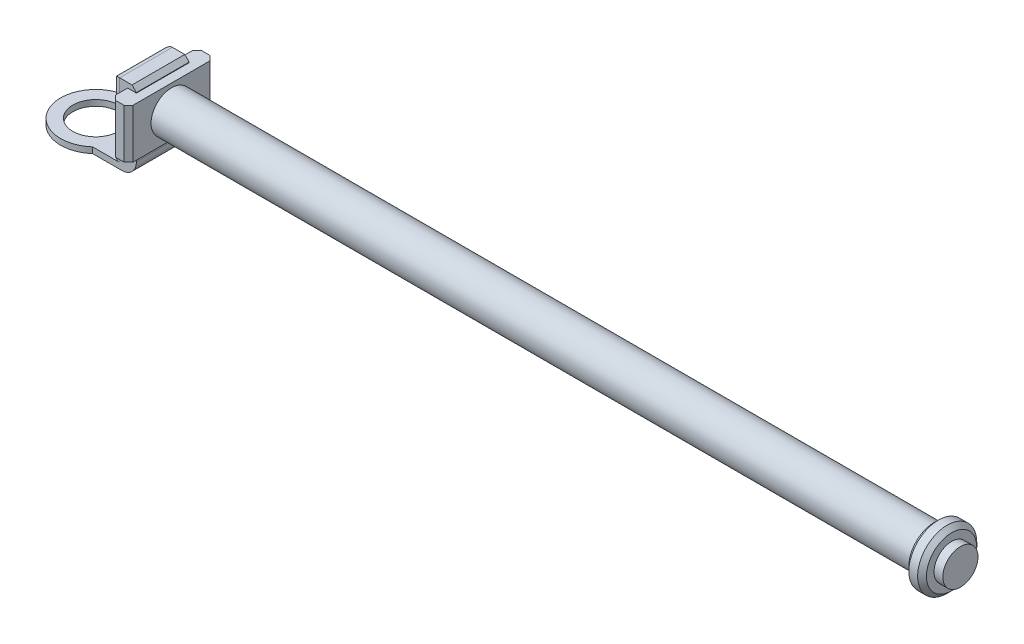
from build123d import *

# Parameters (mm, degrees)
SKETCH1_R                = 12
SKETCH1_R_2              = 7.8
BOSS_EXTRUDE1_DEPTH      = 2
BOSS_EXTRUDE2_DEPTH      = 2
SKETCH3_W                = 8.208087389
SKETCH3_H                = 18
BOSS_EXTRUDE3_DEPTH      = 25
SKETCH4_W                = 7.139122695
SKETCH4_H                = 18
CUT_EXTRUDE1_DEPTH       = 18
FILLET1_R                = 5
FILLET2_R                = 2.5
BOSS_EXTRUDE4_DEPTH      = 3
BOSS_EXTRUDE4_DEPTH_BACK = 3
SKETCH5_W                = 29.376771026
SKETCH5_H                = 16.814336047
CHAMFER1_SIZE            = 1.5
CHAMFER2_SIZE            = 1.5
SKETCH6_R                = 7
BOSS_EXTRUDE9_DEPTH      = 260
SKETCH13_R               = 10.081170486
BOSS_EXTRUDE13_DEPTH     = 6
SKETCH14_R               = 6
BOSS_EXTRUDE14_DEPTH     = 3
CHAMFER5_SIZE            = 1.5


with BuildPart() as part:
    # Sketch1 → Boss-Extrude1 (new body)
    with BuildSketch(Plane(origin=(0, 0, 0), x_dir=(1, 0, 0), z_dir=(0, 1, 0))):
        with Locations(Location((0, 0, 0), (0, 0, 270))):
            Circle(SKETCH1_R)
        with Locations(Location((0, 0, 0), (0, 0, 270))):
            Circle(SKETCH1_R_2, mode=Mode.SUBTRACT)
    extrude(amount=BOSS_EXTRUDE1_DEPTH)

    # Sketch2 → Boss-Extrude2 (add)
    with BuildSketch(Plane.XZ):
        with BuildLine():
            Line((29.994606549, 9), (7.937253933, 9))
            ThreePointArc((7.937253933, 9), (10.937253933, 4.937253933), (12, 0))
            ThreePointArc((12, 0), (10.937253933, -4.937253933), (7.937253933, -9))
            Line((7.937253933, -9), (29.994606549, -9))
            Line((29.994606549, -9), (29.994606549, 9))
        make_face()
    extrude(amount=-BOSS_EXTRUDE2_DEPTH)

    # Sketch3 → Boss-Extrude3 (add)
    with BuildSketch(Plane(origin=(0, 2, 0), x_dir=(1, 0, 0), z_dir=(0, 1, 0))):
        with Locations((18.75144016, 0)):
            Rectangle(SKETCH3_W, SKETCH3_H)
    extrude(amount=BOSS_EXTRUDE3_DEPTH)

    # Sketch4 → Cut-Extrude1 (cut)
    with BuildSketch(Plane(origin=(0, 2, 0), x_dir=(1, 0, 0), z_dir=(0, 1, 0))):
        with Locations((26.425045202, 0)):
            Rectangle(SKETCH4_W, SKETCH4_H)
    extrude(amount=-CUT_EXTRUDE1_DEPTH, mode=Mode.SUBTRACT)

    # Fillet1
    fillet1_edges = [part.edges().sort_by_distance(p)[0] for p in [
        (22.855483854, 0, 0),
    ]]
    fillet(fillet1_edges, radius=FILLET1_R)

    # Fillet2
    fillet2_edges = [part.edges().sort_by_distance(p)[0] for p in [
        (14.647396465, 14.5, 9),
        (14.647396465, 14.5, -9),
        (14.647396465, 27, 0),
    ]]
    fillet(fillet2_edges, radius=FILLET2_R)

    # Sketch5 → Boss-Extrude4 (add, two sides: drawn at the far end of the back side and taken through both)
    with BuildSketch(Plane(origin=(22.855483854, 0, 0), x_dir=(0, 0, -1), z_dir=(1, 0, 0)).offset(-BOSS_EXTRUDE4_DEPTH_BACK)):
        with Locations((0, 16.918829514)):
            Rectangle(SKETCH5_W, SKETCH5_H)
    extrude(amount=BOSS_EXTRUDE4_DEPTH + BOSS_EXTRUDE4_DEPTH_BACK)

    # Chamfer1
    chamfer1_edges = [part.edges().sort_by_distance(p)[0] for p in [
        (22.855483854, 27, 0),
    ]]
    chamfer(chamfer1_edges, length=CHAMFER1_SIZE)

    # Chamfer2
    chamfer2_edges = [part.edges().sort_by_distance(p)[0] for p in [
        (19.855483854, 16.918829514, -14.688385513),
        (19.855483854, 16.918829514, 14.688385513),
        (25.855483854, 16.918829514, -14.688385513),
        (25.855483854, 16.918829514, 14.688385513),
    ]]
    chamfer(chamfer2_edges, length=CHAMFER2_SIZE)

    # Sketch6 → Boss-Extrude9 (add)
    with BuildSketch(Plane(origin=(25.855483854, 0, 0), x_dir=(0, 0, -1), z_dir=(1, 0, 0))):
        with Locations(Location((0, 16.918829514, 0), (0, 0, 180))):
            Circle(SKETCH6_R)
    extrude(amount=BOSS_EXTRUDE9_DEPTH)

    # Sketch13 → Boss-Extrude13 (add)
    with BuildSketch(Plane(origin=(285.855483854, 0, 0), x_dir=(0, 0, -1), z_dir=(1, 0, 0))):
        with Locations((0, 16.918829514)):
            Circle(SKETCH13_R)
    extrude(amount=BOSS_EXTRUDE13_DEPTH)

    # Sketch14 → Boss-Extrude14 (add)
    with BuildSketch(Plane(origin=(291.855483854, 0, 0), x_dir=(0, 0, -1), z_dir=(1, 0, 0))):
        with Locations((0, 16.918829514)):
            Circle(SKETCH14_R)
    extrude(amount=BOSS_EXTRUDE14_DEPTH)

    # Chamfer5
    chamfer5_edges = [part.edges().sort_by_distance(p)[0] for p in [
        (285.855483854, 16.918829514, 10.081170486),
        (291.855483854, 16.918829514, 10.081170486),
    ]]
    chamfer(chamfer5_edges, length=CHAMFER5_SIZE)


solid = part.part
